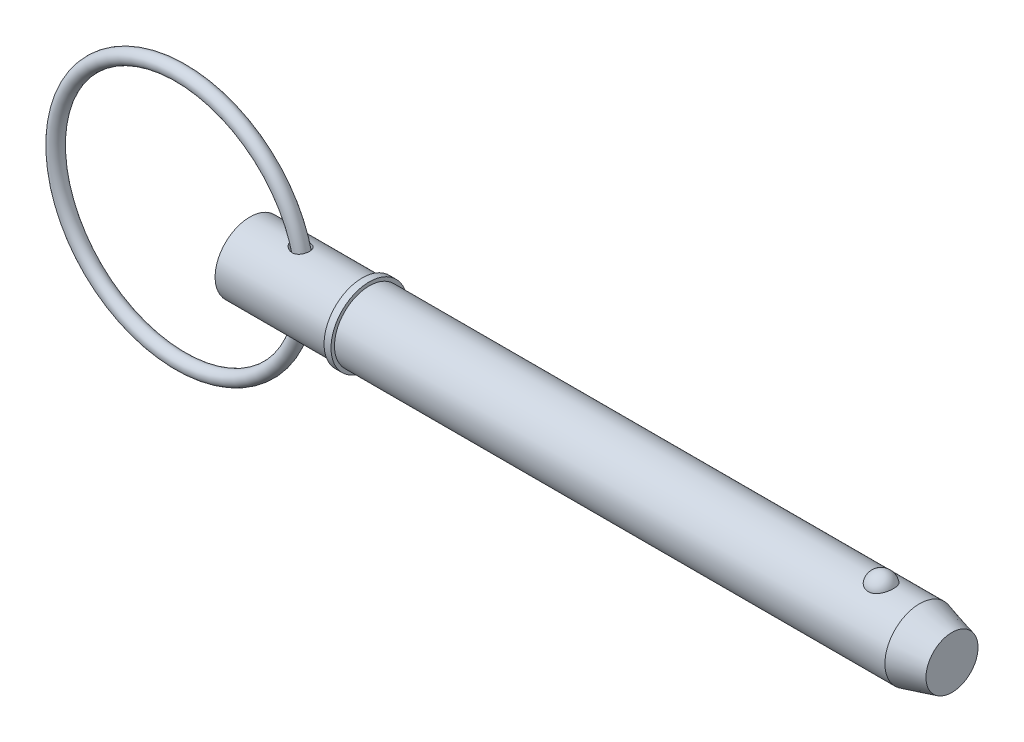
ISO-10303-21;
HEADER;
FILE_DESCRIPTION(('STEP AP214'),'2;1');
FILE_NAME('part.step','',(''),(''),'','','');
FILE_SCHEMA(('AUTOMOTIVE_DESIGN { 1 0 10303 214 1 1 1 1 }'));
ENDSEC;
DATA;
#1=APPLICATION_CONTEXT('core data for automotive mechanical design processes');
#2=APPLICATION_PROTOCOL_DEFINITION('international standard','automotive_design',2000,#1);
#3=PRODUCT_CONTEXT('',#1,'mechanical');
#4=PRODUCT('Part','Part','',(#3));
#5=PRODUCT_RELATED_PRODUCT_CATEGORY('part','',(#4));
#6=PRODUCT_DEFINITION_FORMATION('','',#4);
#7=PRODUCT_DEFINITION_CONTEXT('part definition',#1,'design');
#8=PRODUCT_DEFINITION('design','',#6,#7);
#9=PRODUCT_DEFINITION_SHAPE('','',#8);
#10=(LENGTH_UNIT() NAMED_UNIT(*) SI_UNIT(.MILLI.,.METRE.));
#11=(NAMED_UNIT(*) PLANE_ANGLE_UNIT() SI_UNIT($,.RADIAN.));
#12=(NAMED_UNIT(*) SI_UNIT($,.STERADIAN.) SOLID_ANGLE_UNIT());
#13=UNCERTAINTY_MEASURE_WITH_UNIT(LENGTH_MEASURE(1.E-05),#10,'distance_accuracy_value','');
#14=(GEOMETRIC_REPRESENTATION_CONTEXT(3) GLOBAL_UNCERTAINTY_ASSIGNED_CONTEXT((#13)) GLOBAL_UNIT_ASSIGNED_CONTEXT((#10,
#11,#12)) REPRESENTATION_CONTEXT('',''));
#15=CARTESIAN_POINT('',(0.,0.,0.));
#16=DIRECTION('',(0.,0.,1.));
#17=DIRECTION('',(1.,0.,0.));
#18=AXIS2_PLACEMENT_3D('',#15,#16,#17);
#19=CARTESIAN_POINT('',(-15.855506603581,0.,0.));
#20=DIRECTION('',(0.,0.,1.));
#21=DIRECTION('',(1.,0.,0.));
#22=AXIS2_PLACEMENT_3D('',#19,#20,#21);
#23=TOROIDAL_SURFACE('',#22,28.575,1.588);
#24=CARTESIAN_POINT('',(14.307493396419,0.,0.));
#25=VERTEX_POINT('',#24);
#26=VERTEX_LOOP('',#25);
#27=FACE_BOUND('',#26,.T.);
#28=ADVANCED_FACE('P0_F12',(#27),#23,.T.);
#29=CLOSED_SHELL('',(#28));
#30=MANIFOLD_SOLID_BREP('P0_B1',#29);
#31=CARTESIAN_POINT('',(0.,0.,0.));
#32=DIRECTION('',(1.,0.,0.));
#33=DIRECTION('',(0.,0.,-1.));
#34=AXIS2_PLACEMENT_3D('',#31,#32,#33);
#35=CYLINDRICAL_SURFACE('',#34,7.94);
#36=CARTESIAN_POINT('',(9.9064878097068,7.86092706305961,-1.11777712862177));
#37=CARTESIAN_POINT('',(9.98046148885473,7.84701054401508,-1.21564239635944));
#38=CARTESIAN_POINT('',(10.0632949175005,7.83217804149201,-1.30680329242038));
#39=CARTESIAN_POINT('',(10.243327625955,7.80247884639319,-1.47382688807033));
#40=CARTESIAN_POINT('',(10.3405572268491,7.78761214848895,-1.54965647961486));
#41=CARTESIAN_POINT('',(10.5460150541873,7.75960959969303,-1.6842723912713));
#42=CARTESIAN_POINT('',(10.654212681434,7.74646915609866,-1.74310445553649));
#43=CARTESIAN_POINT('',(10.8789333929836,7.72340979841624,-1.84259563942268));
#44=CARTESIAN_POINT('',(10.9954527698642,7.71348946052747,-1.88326279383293));
#45=CARTESIAN_POINT('',(11.2371543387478,7.69793327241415,-1.94589519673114));
#46=CARTESIAN_POINT('',(11.3624861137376,7.69242163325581,-1.96732022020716));
#47=CARTESIAN_POINT('',(11.6151110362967,7.68708151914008,-1.98809161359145));
#48=CARTESIAN_POINT('',(11.7424035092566,7.68725113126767,-1.98744541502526));
#49=CARTESIAN_POINT('',(11.9871377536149,7.69329740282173,-1.96389977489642));
#50=CARTESIAN_POINT('',(12.1047148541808,7.69883374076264,-1.94232728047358));
#51=CARTESIAN_POINT('',(12.3339179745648,7.7145667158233,-1.87886184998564));
#52=CARTESIAN_POINT('',(12.445546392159,7.72476145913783,-1.83697717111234));
#53=CARTESIAN_POINT('',(12.6521036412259,7.7477815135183,-1.73721211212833));
#54=CARTESIAN_POINT('',(12.7476463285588,7.76039274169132,-1.68054854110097));
#55=CARTESIAN_POINT('',(12.9274536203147,7.7871582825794,-1.55179691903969));
#56=CARTESIAN_POINT('',(13.0117191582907,7.8013124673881,-1.47971014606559));
#57=CARTESIAN_POINT('',(13.16544092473,7.82932755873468,-1.32341211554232));
#58=CARTESIAN_POINT('',(13.2351086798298,7.84318958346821,-1.23940873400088));
#59=CARTESIAN_POINT('',(13.3595610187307,7.86933512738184,-1.06080152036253));
#60=CARTESIAN_POINT('',(13.4143450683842,7.88161858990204,-0.966197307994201));
#61=CARTESIAN_POINT('',(13.5082288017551,7.90340571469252,-0.767990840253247));
#62=CARTESIAN_POINT('',(13.5471601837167,7.91287927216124,-0.664305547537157));
#63=CARTESIAN_POINT('',(13.6076213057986,7.92785679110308,-0.451705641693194));
#64=CARTESIAN_POINT('',(13.6291504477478,7.93336061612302,-0.342790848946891));
#65=CARTESIAN_POINT('',(13.6544025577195,7.93983472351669,-0.12204266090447));
#66=CARTESIAN_POINT('',(13.6580055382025,7.94077445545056,-0.0101946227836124));
#67=CARTESIAN_POINT('',(13.6469977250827,7.93793630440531,0.212542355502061));
#68=CARTESIAN_POINT('',(13.6323866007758,7.93415833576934,0.323431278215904));
#69=CARTESIAN_POINT('',(13.5852649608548,7.92228583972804,0.541194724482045));
#70=CARTESIAN_POINT('',(13.5527398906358,7.91418780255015,0.648065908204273));
#71=CARTESIAN_POINT('',(13.4705326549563,7.8945509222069,0.854658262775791));
#72=CARTESIAN_POINT('',(13.4208502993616,7.88301204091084,0.954379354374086));
#73=CARTESIAN_POINT('',(13.3056021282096,7.85778224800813,1.14366619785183));
#74=CARTESIAN_POINT('',(13.2400609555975,7.8440946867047,1.23324739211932));
#75=CARTESIAN_POINT('',(13.0946981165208,7.8160855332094,1.39984119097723));
#76=CARTESIAN_POINT('',(13.0148777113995,7.80176399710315,1.47685490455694));
#77=CARTESIAN_POINT('',(12.8438529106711,7.774237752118,1.61548556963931));
#78=CARTESIAN_POINT('',(12.7527554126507,7.76102428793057,1.67723263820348));
#79=CARTESIAN_POINT('',(12.5611987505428,7.73705789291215,1.78453696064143));
#80=CARTESIAN_POINT('',(12.4607407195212,7.72630466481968,1.83009617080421));
#81=CARTESIAN_POINT('',(12.2541997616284,7.70849465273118,1.90371822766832));
#82=CARTESIAN_POINT('',(12.1481665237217,7.7014098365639,1.93191408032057));
#83=CARTESIAN_POINT('',(11.9327851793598,7.69148605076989,1.97105353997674));
#84=CARTESIAN_POINT('',(11.8234367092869,7.68864754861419,1.98199524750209));
#85=CARTESIAN_POINT('',(11.6016024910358,7.68735890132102,1.98698770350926));
#86=CARTESIAN_POINT('',(11.4891069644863,7.68902083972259,1.98060702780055));
#87=CARTESIAN_POINT('',(11.2665484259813,7.6966276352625,1.95083303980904));
#88=CARTESIAN_POINT('',(11.1564861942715,7.70257384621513,1.92743434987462));
#89=CARTESIAN_POINT('',(10.9339966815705,7.71853798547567,1.86251478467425));
#90=CARTESIAN_POINT('',(10.8219140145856,7.72880438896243,1.81987394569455));
#91=CARTESIAN_POINT('',(10.6060441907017,7.75216432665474,1.7176403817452));
#92=CARTESIAN_POINT('',(10.5022611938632,7.76525926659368,1.65803922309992));
#93=CARTESIAN_POINT('',(10.3000447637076,7.79362794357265,1.51929354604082));
#94=CARTESIAN_POINT('',(10.2022480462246,7.80898310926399,1.43923272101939));
#95=CARTESIAN_POINT('',(10.0221668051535,7.83939672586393,1.26310118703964));
#96=CARTESIAN_POINT('',(9.93988168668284,7.85445518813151,1.16703109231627));
#97=CARTESIAN_POINT('',(9.79729823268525,7.88178950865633,0.964874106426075));
#98=CARTESIAN_POINT('',(9.73627994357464,7.89414970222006,0.859310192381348));
#99=CARTESIAN_POINT('',(9.63554001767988,7.91508909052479,0.638143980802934));
#100=CARTESIAN_POINT('',(9.59578986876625,7.92367334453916,0.522555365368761));
#101=CARTESIAN_POINT('',(9.54388714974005,7.93499161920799,0.300466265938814));
#102=CARTESIAN_POINT('',(9.52888458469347,7.93832727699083,0.194660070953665));
#103=CARTESIAN_POINT('',(9.51823078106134,7.94068976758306,-0.0179747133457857));
#104=CARTESIAN_POINT('',(9.52257317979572,7.93971801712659,-0.12480295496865));
#105=CARTESIAN_POINT('',(9.54911264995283,7.93386114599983,-0.326814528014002));
#106=CARTESIAN_POINT('',(9.56976509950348,7.92931471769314,-0.422217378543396));
#107=CARTESIAN_POINT('',(9.62591284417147,7.91721462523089,-0.608271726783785));
#108=CARTESIAN_POINT('',(9.66139801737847,7.90966301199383,-0.698926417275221));
#109=CARTESIAN_POINT('',(9.7317197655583,7.89515389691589,-0.844763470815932));
#110=CARTESIAN_POINT('',(9.76292633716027,7.88881879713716,-0.901801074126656));
#111=CARTESIAN_POINT('',(9.83075962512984,7.87538342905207,-1.01244242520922));
#112=CARTESIAN_POINT('',(9.86738597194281,7.86828321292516,-1.06604640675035));
#113=CARTESIAN_POINT('',(9.9064878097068,7.86092706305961,-1.11777712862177));
#114=B_SPLINE_CURVE_WITH_KNOTS('',3,(#36,#37,#38,#39,#40,#41,#42,#43,#44,#45,#46,#47,#48,#49,
#50,#51,#52,#53,#54,#55,#56,#57,#58,#59,#60,#61,#62,#63,#64,#65,#66,#67,#68,#69,#70,#71,#72,#73,
#74,#75,#76,#77,#78,#79,#80,#81,#82,#83,#84,#85,#86,#87,#88,#89,#90,#91,#92,#93,#94,#95,#96,#97,
#98,#99,#100,#101,#102,#103,#104,#105,#106,#107,#108,#109,#110,#111,#112,#113),.UNSPECIFIED.,
.T.,.F.,(4,2,2,2,2,2,2,2,2,2,2,2,2,2,2,2,2,2,2,2,2,2,2,2,2,2,2,2,2,2,2,2,2,2,2,2,2,2,4),(0.,
0.370138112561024,0.741067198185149,1.11098852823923,1.48074607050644,1.86058657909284,
2.24029919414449,2.59740885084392,2.95437345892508,3.2881332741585,3.6218654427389,
3.95036374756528,4.27887384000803,4.61078596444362,4.94270949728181,5.27685177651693,
5.61100012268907,5.94542035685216,6.27984429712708,6.61375187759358,6.94762997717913,
7.27855592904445,7.60944187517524,7.93776058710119,8.26611544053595,8.60272268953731,
8.93943635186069,9.29895306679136,9.65864886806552,10.0387340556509,10.4188046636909,
10.7843533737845,11.1494107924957,11.4683925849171,11.7872694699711,12.0791172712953,
12.3707662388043,12.5664313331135,12.7620830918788),.UNSPECIFIED.);
#115=CARTESIAN_POINT('',(9.9064878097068,7.86092706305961,-1.11777712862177));
#116=VERTEX_POINT('',#115);
#117=EDGE_CURVE('P1_E42',#116,#116,#114,.T.);
#118=ORIENTED_EDGE('',*,*,#117,.T.);
#119=EDGE_LOOP('',(#118));
#120=FACE_BOUND('',#119,.T.);
#121=CARTESIAN_POINT('',(0.,0.,0.));
#122=DIRECTION('',(1.,0.,0.));
#123=DIRECTION('',(0.,0.,-1.));
#124=AXIS2_PLACEMENT_3D('',#121,#122,#123);
#125=CIRCLE('',#124,7.94);
#126=CARTESIAN_POINT('',(0.,0.,-7.94));
#127=VERTEX_POINT('',#126);
#128=EDGE_CURVE('P1_E9',#127,#127,#125,.T.);
#129=ORIENTED_EDGE('',*,*,#128,.T.);
#130=EDGE_LOOP('',(#129));
#131=FACE_BOUND('',#130,.T.);
#132=CARTESIAN_POINT('',(25.722,0.,0.));
#133=DIRECTION('',(1.,0.,0.));
#134=DIRECTION('',(0.,0.,-1.));
#135=AXIS2_PLACEMENT_3D('',#132,#133,#134);
#136=CIRCLE('',#135,7.94);
#137=CARTESIAN_POINT('',(25.722,0.,-7.94));
#138=VERTEX_POINT('',#137);
#139=EDGE_CURVE('P1_E25',#138,#138,#136,.T.);
#140=ORIENTED_EDGE('',*,*,#139,.F.);
#141=EDGE_LOOP('',(#140));
#142=FACE_BOUND('',#141,.T.);
#143=CARTESIAN_POINT('',(9.9064878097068,-7.86092706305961,-1.11777712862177));
#144=CARTESIAN_POINT('',(9.84378768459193,-7.87272256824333,-1.03482250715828));
#145=CARTESIAN_POINT('',(9.7874122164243,-7.88386682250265,-0.947002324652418));
#146=CARTESIAN_POINT('',(9.68947008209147,-7.90377389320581,-0.763202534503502));
#147=CARTESIAN_POINT('',(9.64789384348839,-7.91253824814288,-0.667228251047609));
#148=CARTESIAN_POINT('',(9.58141396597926,-7.92676779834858,-0.468898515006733));
#149=CARTESIAN_POINT('',(9.55658638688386,-7.93221793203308,-0.366516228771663));
#150=CARTESIAN_POINT('',(9.525398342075,-7.9390896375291,-0.158837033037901));
#151=CARTESIAN_POINT('',(9.51903196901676,-7.94051249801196,-0.0535410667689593));
#152=CARTESIAN_POINT('',(9.5249639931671,-7.93919670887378,0.149856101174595));
#153=CARTESIAN_POINT('',(9.53611757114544,-7.9367132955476,0.247994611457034));
#154=CARTESIAN_POINT('',(9.57435037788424,-7.92833496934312,0.440949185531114));
#155=CARTESIAN_POINT('',(9.60143086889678,-7.92243978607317,0.535764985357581));
#156=CARTESIAN_POINT('',(9.67027872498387,-7.90782830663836,0.720026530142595));
#157=CARTESIAN_POINT('',(9.71210005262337,-7.89910165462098,0.809451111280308));
#158=CARTESIAN_POINT('',(9.80864905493,-7.87966534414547,0.980775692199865));
#159=CARTESIAN_POINT('',(9.86338092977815,-7.86895504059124,1.06267323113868));
#160=CARTESIAN_POINT('',(9.99009906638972,-7.84531573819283,1.22559225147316));
#161=CARTESIAN_POINT('',(10.0632770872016,-7.8322718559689,1.30566871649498));
#162=CARTESIAN_POINT('',(10.2208237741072,-7.80611237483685,1.45392159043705));
#163=CARTESIAN_POINT('',(10.3051986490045,-7.79299674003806,1.52209134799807));
#164=CARTESIAN_POINT('',(10.4935539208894,-7.76638841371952,1.65280871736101));
#165=CARTESIAN_POINT('',(10.5986730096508,-7.75303312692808,1.71374951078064));
#166=CARTESIAN_POINT('',(10.8175805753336,-7.72920597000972,1.81820073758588));
#167=CARTESIAN_POINT('',(10.9313721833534,-7.71873514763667,1.86170483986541));
#168=CARTESIAN_POINT('',(11.1696833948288,-7.70161777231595,1.93133079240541));
#169=CARTESIAN_POINT('',(11.2944525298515,-7.69514907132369,1.95665138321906));
#170=CARTESIAN_POINT('',(11.5466607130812,-7.6877908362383,1.98537345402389));
#171=CARTESIAN_POINT('',(11.6740986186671,-7.68689896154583,1.98878412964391));
#172=CARTESIAN_POINT('',(11.9206005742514,-7.690938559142,1.97309854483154));
#173=CARTESIAN_POINT('',(12.0397453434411,-7.69555832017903,1.95520713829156));
#174=CARTESIAN_POINT('',(12.2727177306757,-7.70968728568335,1.89872693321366));
#175=CARTESIAN_POINT('',(12.3865475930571,-7.71919440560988,1.86014695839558));
#176=CARTESIAN_POINT('',(12.5975118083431,-7.74115679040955,1.76641559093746));
#177=CARTESIAN_POINT('',(12.6952552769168,-7.75336701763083,1.71257254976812));
#178=CARTESIAN_POINT('',(12.8798510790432,-7.77962828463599,1.58901145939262));
#179=CARTESIAN_POINT('',(12.9667044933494,-7.79367914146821,1.51929498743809));
#180=CARTESIAN_POINT('',(13.1254818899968,-7.82172079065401,1.36751778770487));
#181=CARTESIAN_POINT('',(13.1976693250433,-7.83570718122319,1.28573131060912));
#182=CARTESIAN_POINT('',(13.3274495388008,-7.86236718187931,1.11111271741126));
#183=CARTESIAN_POINT('',(13.3850418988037,-7.87504075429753,1.01828028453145));
#184=CARTESIAN_POINT('',(13.4847470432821,-7.89782512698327,0.823214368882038));
#185=CARTESIAN_POINT('',(13.5267056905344,-7.90791011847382,0.720899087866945));
#186=CARTESIAN_POINT('',(13.5933891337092,-7.92427335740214,0.510509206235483));
#187=CARTESIAN_POINT('',(13.6181132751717,-7.9305514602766,0.402434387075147));
#188=CARTESIAN_POINT('',(13.6498843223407,-7.93866355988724,0.182728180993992));
#189=CARTESIAN_POINT('',(13.6567982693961,-7.94046412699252,0.07107630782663));
#190=CARTESIAN_POINT('',(13.6524060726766,-7.93933046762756,-0.151845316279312));
#191=CARTESIAN_POINT('',(13.6410996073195,-7.93639615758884,-0.26311506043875));
#192=CARTESIAN_POINT('',(13.6005023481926,-7.92610202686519,-0.482238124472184));
#193=CARTESIAN_POINT('',(13.571192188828,-7.91873744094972,-0.590087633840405));
#194=CARTESIAN_POINT('',(13.495246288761,-7.90037565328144,-0.799178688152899));
#195=CARTESIAN_POINT('',(13.4486102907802,-7.88937839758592,-0.900420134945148));
#196=CARTESIAN_POINT('',(13.3391817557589,-7.86497175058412,-1.09328280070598));
#197=CARTESIAN_POINT('',(13.2764083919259,-7.85156522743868,-1.18491525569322));
#198=CARTESIAN_POINT('',(13.1362355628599,-7.8238261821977,-1.35604994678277));
#199=CARTESIAN_POINT('',(13.0588372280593,-7.80949373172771,-1.43555311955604));
#200=CARTESIAN_POINT('',(12.8921392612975,-7.78164292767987,-1.57955181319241));
#201=CARTESIAN_POINT('',(12.8029410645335,-7.76811892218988,-1.64416363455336));
#202=CARTESIAN_POINT('',(12.6146622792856,-7.74328422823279,-1.75742016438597));
#203=CARTESIAN_POINT('',(12.5155829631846,-7.73197325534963,-1.80606692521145));
#204=CARTESIAN_POINT('',(12.31135301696,-7.71289290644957,-1.88588502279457));
#205=CARTESIAN_POINT('',(12.2062651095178,-7.70509254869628,-1.91720981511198));
#206=CARTESIAN_POINT('',(11.9922253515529,-7.69365188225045,-1.96261878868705));
#207=CARTESIAN_POINT('',(11.8832731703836,-7.69001193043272,-1.97670149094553));
#208=CARTESIAN_POINT('',(11.662174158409,-7.6871142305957,-1.98794112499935));
#209=CARTESIAN_POINT('',(11.5500082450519,-7.6879499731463,-1.98473694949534));
#210=CARTESIAN_POINT('',(11.3276038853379,-7.69396349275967,-1.96129119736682));
#211=CARTESIAN_POINT('',(11.2173659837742,-7.6991424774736,-1.94104488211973));
#212=CARTESIAN_POINT('',(10.9943151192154,-7.71363470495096,-1.8826578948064));
#213=CARTESIAN_POINT('',(10.8818004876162,-7.72319478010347,-1.8434396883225));
#214=CARTESIAN_POINT('',(10.6644693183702,-7.74534199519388,-1.74804607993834));
#215=CARTESIAN_POINT('',(10.5596578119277,-7.75793109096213,-1.69185971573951));
#216=CARTESIAN_POINT('',(10.3538333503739,-7.78563853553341,-1.5595801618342));
#217=CARTESIAN_POINT('',(10.2535123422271,-7.80086820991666,-1.48242881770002));
#218=CARTESIAN_POINT('',(10.0678634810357,-7.83136022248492,-1.31182139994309));
#219=CARTESIAN_POINT('',(9.98252491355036,-7.84662252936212,-1.21837707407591));
#220=CARTESIAN_POINT('',(9.9064878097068,-7.86092706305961,-1.11777712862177));
#221=B_SPLINE_CURVE_WITH_KNOTS('',3,(#143,#144,#145,#146,#147,#148,#149,#150,#151,#152,#153,
#154,#155,#156,#157,#158,#159,#160,#161,#162,#163,#164,#165,#166,#167,#168,#169,#170,#171,#172,
#173,#174,#175,#176,#177,#178,#179,#180,#181,#182,#183,#184,#185,#186,#187,#188,#189,#190,#191,
#192,#193,#194,#195,#196,#197,#198,#199,#200,#201,#202,#203,#204,#205,#206,#207,#208,#209,#210,
#211,#212,#213,#214,#215,#216,#217,#218,#219,#220),.UNSPECIFIED.,.T.,.F.,(4,2,2,2,2,2,2,2,2,2,2,
2,2,2,2,2,2,2,2,2,2,2,2,2,2,2,2,2,2,2,2,2,2,2,2,2,2,2,4),(0.,0.313593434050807,
0.626983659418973,0.941787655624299,1.25649090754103,1.55146990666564,1.84647228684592,
2.14256601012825,2.4387561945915,2.76521830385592,3.09186220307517,3.45696288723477,
3.82219601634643,4.20267276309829,4.58298981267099,4.94277962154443,5.30241610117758,
5.63754619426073,5.97264300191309,6.301049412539,6.62946524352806,6.96103833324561,
7.29262401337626,7.62667800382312,7.96073789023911,8.29515773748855,8.6295825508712,
8.96361184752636,9.29761533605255,9.62891449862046,9.96017105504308,10.288443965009,
10.616745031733,10.951930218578,11.2872086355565,11.6442788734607,12.0015802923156,
12.3821516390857,12.762449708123),.UNSPECIFIED.);
#222=CARTESIAN_POINT('',(9.9064878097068,-7.86092706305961,-1.11777712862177));
#223=VERTEX_POINT('',#222);
#224=EDGE_CURVE('P1_E17',#223,#223,#221,.T.);
#225=ORIENTED_EDGE('',*,*,#224,.T.);
#226=EDGE_LOOP('',(#225));
#227=FACE_BOUND('',#226,.T.);
#228=ADVANCED_FACE('P1_F13',(#120,#131,#142,#227),#35,.T.);
#229=CARTESIAN_POINT('',(0.,0.,0.));
#230=DIRECTION('',(1.,0.,0.));
#231=DIRECTION('',(0.,0.,-1.));
#232=AXIS2_PLACEMENT_3D('',#229,#230,#231);
#233=CYLINDRICAL_SURFACE('',#232,7.94);
#234=CARTESIAN_POINT('',(153.251879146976,0.,0.));
#235=DIRECTION('',(1.,0.,0.));
#236=DIRECTION('',(0.,0.,-1.));
#237=AXIS2_PLACEMENT_3D('',#234,#235,#236);
#238=CIRCLE('',#237,7.94);
#239=CARTESIAN_POINT('',(153.251879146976,0.,-7.94));
#240=VERTEX_POINT('',#239);
#241=EDGE_CURVE('P1_E99',#240,#240,#238,.T.);
#242=ORIENTED_EDGE('',*,*,#241,.F.);
#243=EDGE_LOOP('',(#242));
#244=FACE_BOUND('',#243,.T.);
#245=CARTESIAN_POINT('',(27.31,0.,0.));
#246=DIRECTION('',(1.,0.,0.));
#247=DIRECTION('',(0.,0.,-1.));
#248=AXIS2_PLACEMENT_3D('',#245,#246,#247);
#249=CIRCLE('',#248,7.94);
#250=CARTESIAN_POINT('',(27.31,0.,-7.94));
#251=VERTEX_POINT('',#250);
#252=EDGE_CURVE('P1_E96',#251,#251,#249,.T.);
#253=ORIENTED_EDGE('',*,*,#252,.T.);
#254=EDGE_LOOP('',(#253));
#255=FACE_BOUND('',#254,.T.);
#256=CARTESIAN_POINT('',(144.444907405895,7.37767842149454,2.93486986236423));
#257=CARTESIAN_POINT('',(144.292749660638,7.3776732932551,2.93487505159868));
#258=CARTESIAN_POINT('',(144.140632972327,7.38258419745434,2.92262454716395));
#259=CARTESIAN_POINT('',(143.840928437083,7.40163229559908,2.87404196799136));
#260=CARTESIAN_POINT('',(143.693339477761,7.41576720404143,2.83771585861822));
#261=CARTESIAN_POINT('',(143.407018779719,7.45161576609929,2.74218769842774));
#262=CARTESIAN_POINT('',(143.268274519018,7.47331841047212,2.68301886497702));
#263=CARTESIAN_POINT('',(143.002882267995,7.52194082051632,2.54350967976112));
#264=CARTESIAN_POINT('',(142.876236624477,7.54886159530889,2.46316523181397));
#265=CARTESIAN_POINT('',(142.634534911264,7.60594671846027,2.28090375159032));
#266=CARTESIAN_POINT('',(142.519906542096,7.63618114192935,2.1784421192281));
#267=CARTESIAN_POINT('',(142.308878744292,7.69614046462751,1.95608495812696));
#268=CARTESIAN_POINT('',(142.212482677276,7.72586526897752,1.83618622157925));
#269=CARTESIAN_POINT('',(142.035938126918,7.78314821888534,1.57628086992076));
#270=CARTESIAN_POINT('',(141.956707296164,7.81055035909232,1.43561546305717));
#271=CARTESIAN_POINT('',(141.821797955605,7.85879631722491,1.14236334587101));
#272=CARTESIAN_POINT('',(141.766121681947,7.87963951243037,0.989775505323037));
#273=CARTESIAN_POINT('',(141.67881215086,7.91289645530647,0.674619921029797));
#274=CARTESIAN_POINT('',(141.64753090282,7.92518652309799,0.511941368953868));
#275=CARTESIAN_POINT('',(141.610975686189,7.93958930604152,0.183247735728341));
#276=CARTESIAN_POINT('',(141.605701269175,7.94170219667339,0.0172327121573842));
#277=CARTESIAN_POINT('',(141.621231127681,7.93554931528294,-0.312672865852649));
#278=CARTESIAN_POINT('',(141.641925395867,7.92732732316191,-0.476569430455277));
#279=CARTESIAN_POINT('',(141.70878655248,7.90141534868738,-0.79830524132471));
#280=CARTESIAN_POINT('',(141.754953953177,7.88372517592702,-0.956144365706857));
#281=CARTESIAN_POINT('',(141.871898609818,7.84066230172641,-1.26152073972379));
#282=CARTESIAN_POINT('',(141.942704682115,7.81528060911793,-1.40904568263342));
#283=CARTESIAN_POINT('',(142.107478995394,7.75948672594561,-1.68950598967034));
#284=CARTESIAN_POINT('',(142.201448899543,7.72907417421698,-1.82244030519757));
#285=CARTESIAN_POINT('',(142.410839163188,7.66640424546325,-2.07032792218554));
#286=CARTESIAN_POINT('',(142.526315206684,7.63414223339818,-2.18523308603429));
#287=CARTESIAN_POINT('',(142.7759006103,7.57149681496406,-2.39329737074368));
#288=CARTESIAN_POINT('',(142.910008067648,7.54111321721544,-2.48645870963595));
#289=CARTESIAN_POINT('',(143.190111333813,7.48650742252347,-2.64628132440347));
#290=CARTESIAN_POINT('',(143.335760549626,7.46215900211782,-2.71350554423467));
#291=CARTESIAN_POINT('',(143.637425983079,7.42171253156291,-2.82226614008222));
#292=CARTESIAN_POINT('',(143.793438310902,7.40561140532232,-2.86381209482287));
#293=CARTESIAN_POINT('',(144.102970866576,7.3842679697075,-2.9183907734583));
#294=CARTESIAN_POINT('',(144.256222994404,7.37852109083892,-2.93275024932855));
#295=CARTESIAN_POINT('',(144.563070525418,7.37700973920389,-2.93655208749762));
#296=CARTESIAN_POINT('',(144.716665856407,7.38124333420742,-2.92599927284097));
#297=CARTESIAN_POINT('',(145.014990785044,7.39890635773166,-2.88102897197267));
#298=CARTESIAN_POINT('',(145.159848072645,7.41205491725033,-2.84733999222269));
#299=CARTESIAN_POINT('',(145.44164329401,7.445801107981,-2.75788206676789));
#300=CARTESIAN_POINT('',(145.578580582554,7.46639934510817,-2.70211132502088));
#301=CARTESIAN_POINT('',(145.844061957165,7.51339098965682,-2.56858908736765));
#302=CARTESIAN_POINT('',(145.972354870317,7.53990200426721,-2.4903806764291));
#303=CARTESIAN_POINT('',(146.214244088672,7.59569503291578,-2.31462737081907));
#304=CARTESIAN_POINT('',(146.327837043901,7.6249776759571,-2.21707808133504));
#305=CARTESIAN_POINT('',(146.54322156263,7.68489473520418,-1.99982049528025));
#306=CARTESIAN_POINT('',(146.644148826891,7.71552419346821,-1.87925337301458));
#307=CARTESIAN_POINT('',(146.825186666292,7.77353016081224,-1.6226882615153));
#308=CARTESIAN_POINT('',(146.905293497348,7.80090608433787,-1.48668750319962));
#309=CARTESIAN_POINT('',(147.045361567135,7.85047992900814,-1.1981841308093));
#310=CARTESIAN_POINT('',(147.104587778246,7.87248183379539,-1.04529016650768));
#311=CARTESIAN_POINT('',(147.197982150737,7.90785114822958,-0.731080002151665));
#312=CARTESIAN_POINT('',(147.232149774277,7.92121837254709,-0.569763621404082));
#313=CARTESIAN_POINT('',(147.274795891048,7.93797834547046,-0.242812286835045));
#314=CARTESIAN_POINT('',(147.283204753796,7.94134405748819,-0.0771668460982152));
#315=CARTESIAN_POINT('',(147.273962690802,7.93767937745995,0.253276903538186));
#316=CARTESIAN_POINT('',(147.256312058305,7.93064910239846,0.418075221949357));
#317=CARTESIAN_POINT('',(147.195424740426,7.90695571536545,0.741525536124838));
#318=CARTESIAN_POINT('',(147.152281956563,7.8903279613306,0.900197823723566));
#319=CARTESIAN_POINT('',(147.04135358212,7.84916386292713,1.20759654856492));
#320=CARTESIAN_POINT('',(146.97356656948,7.82462706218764,1.35632241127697));
#321=CARTESIAN_POINT('',(146.814371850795,7.77006699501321,1.64032869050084));
#322=CARTESIAN_POINT('',(146.722861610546,7.74002008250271,1.7755471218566));
#323=CARTESIAN_POINT('',(146.518296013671,7.67774175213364,2.0280064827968));
#324=CARTESIAN_POINT('',(146.405241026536,7.64551037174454,2.14524772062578));
#325=CARTESIAN_POINT('',(146.160831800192,7.58265895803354,2.35778002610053));
#326=CARTESIAN_POINT('',(146.029583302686,7.5520309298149,2.45319004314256));
#327=CARTESIAN_POINT('',(145.751601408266,7.49579792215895,2.61999897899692));
#328=CARTESIAN_POINT('',(145.604867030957,7.4701932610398,2.69139637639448));
#329=CARTESIAN_POINT('',(145.292947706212,7.42622216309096,2.8105324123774));
#330=CARTESIAN_POINT('',(145.127220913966,7.40825002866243,2.85700910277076));
#331=CARTESIAN_POINT('',(144.789279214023,7.38398348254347,2.9191685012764));
#332=CARTESIAN_POINT('',(144.61706702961,7.3776842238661,2.93486399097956));
#333=CARTESIAN_POINT('',(144.444907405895,7.37767842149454,2.93486986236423));
#334=B_SPLINE_CURVE_WITH_KNOTS('',3,(#256,#257,#258,#259,#260,#261,#262,#263,#264,#265,#266,
#267,#268,#269,#270,#271,#272,#273,#274,#275,#276,#277,#278,#279,#280,#281,#282,#283,#284,#285,
#286,#287,#288,#289,#290,#291,#292,#293,#294,#295,#296,#297,#298,#299,#300,#301,#302,#303,#304,
#305,#306,#307,#308,#309,#310,#311,#312,#313,#314,#315,#316,#317,#318,#319,#320,#321,#322,#323,
#324,#325,#326,#327,#328,#329,#330,#331,#332,#333),.UNSPECIFIED.,.T.,.F.,(4,2,2,2,2,2,2,2,2,2,2,
2,2,2,2,2,2,2,2,2,2,2,2,2,2,2,2,2,2,2,2,2,2,2,2,2,2,2,4),(0.,0.455841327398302,
0.911569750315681,1.36663794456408,1.82179423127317,2.2897898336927,2.75787163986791,
3.24685368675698,3.73588214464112,4.23184282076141,4.72779494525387,5.22165321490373,
5.71552141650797,6.20996917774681,6.7044524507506,7.20023431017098,7.69596557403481,
8.18023418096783,8.66432203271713,9.12410697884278,9.58380291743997,10.0296503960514,
10.4755341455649,10.9312349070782,11.3870393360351,11.8654416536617,12.3439299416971,
12.8378875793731,13.3318558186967,13.8271581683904,14.3224549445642,14.8159385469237,
15.3094506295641,15.8051323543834,16.3008055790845,16.7937101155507,17.2866458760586,
17.8026240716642,18.3183879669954),.UNSPECIFIED.);
#335=CARTESIAN_POINT('',(144.444907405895,7.37767842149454,2.93486986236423));
#336=VERTEX_POINT('',#335);
#337=EDGE_CURVE('P1_E34',#336,#336,#334,.T.);
#338=ORIENTED_EDGE('',*,*,#337,.T.);
#339=EDGE_LOOP('',(#338));
#340=FACE_BOUND('',#339,.T.);
#341=ADVANCED_FACE('P1_F46',(#244,#255,#340),#233,.T.);
#342=CARTESIAN_POINT('',(0.,0.,0.));
#343=DIRECTION('',(-1.,0.,0.));
#344=DIRECTION('',(0.,0.,1.));
#345=AXIS2_PLACEMENT_3D('',#342,#343,#344);
#346=PLANE('',#345);
#347=ORIENTED_EDGE('',*,*,#128,.F.);
#348=EDGE_LOOP('',(#347));
#349=FACE_BOUND('',#348,.T.);
#350=ADVANCED_FACE('P1_F15',(#349),#346,.T.);
#351=CARTESIAN_POINT('',(25.722,7.94,0.));
#352=DIRECTION('',(-1.,0.,0.));
#353=DIRECTION('',(0.,0.,1.));
#354=AXIS2_PLACEMENT_3D('',#351,#352,#353);
#355=PLANE('',#354);
#356=ORIENTED_EDGE('',*,*,#139,.T.);
#357=EDGE_LOOP('',(#356));
#358=FACE_BOUND('',#357,.T.);
#359=CARTESIAN_POINT('',(25.722,0.,0.));
#360=DIRECTION('',(1.,0.,0.));
#361=DIRECTION('',(0.,0.,-1.));
#362=AXIS2_PLACEMENT_3D('',#359,#360,#361);
#363=CIRCLE('',#362,8.734);
#364=CARTESIAN_POINT('',(25.722,0.,-8.734));
#365=VERTEX_POINT('',#364);
#366=EDGE_CURVE('P1_E30',#365,#365,#363,.T.);
#367=ORIENTED_EDGE('',*,*,#366,.F.);
#368=EDGE_LOOP('',(#367));
#369=FACE_BOUND('',#368,.T.);
#370=ADVANCED_FACE('P1_F81',(#358,#369),#355,.T.);
#371=CARTESIAN_POINT('',(0.,0.,0.));
#372=DIRECTION('',(1.,0.,0.));
#373=DIRECTION('',(0.,0.,-1.));
#374=AXIS2_PLACEMENT_3D('',#371,#372,#373);
#375=CYLINDRICAL_SURFACE('',#374,8.734);
#376=ORIENTED_EDGE('',*,*,#366,.T.);
#377=EDGE_LOOP('',(#376));
#378=FACE_BOUND('',#377,.T.);
#379=CARTESIAN_POINT('',(27.31,0.,0.));
#380=DIRECTION('',(1.,0.,0.));
#381=DIRECTION('',(0.,0.,-1.));
#382=AXIS2_PLACEMENT_3D('',#379,#380,#381);
#383=CIRCLE('',#382,8.734);
#384=CARTESIAN_POINT('',(27.31,0.,-8.734));
#385=VERTEX_POINT('',#384);
#386=EDGE_CURVE('P1_E95',#385,#385,#383,.T.);
#387=ORIENTED_EDGE('',*,*,#386,.F.);
#388=EDGE_LOOP('',(#387));
#389=FACE_BOUND('',#388,.T.);
#390=ADVANCED_FACE('P1_F68',(#378,#389),#375,.T.);
#391=CARTESIAN_POINT('',(27.31,8.734,0.));
#392=DIRECTION('',(1.,0.,0.));
#393=DIRECTION('',(0.,0.,-1.));
#394=AXIS2_PLACEMENT_3D('',#391,#392,#393);
#395=PLANE('',#394);
#396=ORIENTED_EDGE('',*,*,#386,.T.);
#397=EDGE_LOOP('',(#396));
#398=FACE_BOUND('',#397,.T.);
#399=ORIENTED_EDGE('',*,*,#252,.F.);
#400=EDGE_LOOP('',(#399));
#401=FACE_BOUND('',#400,.T.);
#402=ADVANCED_FACE('P1_F62',(#398,#401),#395,.T.);
#403=CARTESIAN_POINT('',(160.66,0.,0.));
#404=DIRECTION('',(-1.,0.,0.));
#405=DIRECTION('',(0.,0.,1.));
#406=AXIS2_PLACEMENT_3D('',#403,#404,#405);
#407=CONICAL_SURFACE('',#406,5.95500000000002,0.26179938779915);
#408=ORIENTED_EDGE('',*,*,#241,.T.);
#409=EDGE_LOOP('',(#408));
#410=FACE_BOUND('',#409,.T.);
#411=CARTESIAN_POINT('',(160.66,0.,0.));
#412=DIRECTION('',(1.,0.,0.));
#413=DIRECTION('',(0.,0.,-1.));
#414=AXIS2_PLACEMENT_3D('',#411,#412,#413);
#415=CIRCLE('',#414,5.95500000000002);
#416=CARTESIAN_POINT('',(160.66,0.,-5.95500000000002));
#417=VERTEX_POINT('',#416);
#418=EDGE_CURVE('P1_E41',#417,#417,#415,.T.);
#419=ORIENTED_EDGE('',*,*,#418,.F.);
#420=EDGE_LOOP('',(#419));
#421=FACE_BOUND('',#420,.T.);
#422=ADVANCED_FACE('P1_F59',(#410,#421),#407,.T.);
#423=CARTESIAN_POINT('',(160.66,5.95500000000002,0.));
#424=DIRECTION('',(1.,0.,0.));
#425=DIRECTION('',(0.,0.,-1.));
#426=AXIS2_PLACEMENT_3D('',#423,#424,#425);
#427=PLANE('',#426);
#428=ORIENTED_EDGE('',*,*,#418,.T.);
#429=EDGE_LOOP('',(#428));
#430=FACE_BOUND('',#429,.T.);
#431=ADVANCED_FACE('P1_F55',(#430),#427,.T.);
#432=CARTESIAN_POINT('',(144.444907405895,7.146,0.));
#433=DIRECTION('',(-1.,0.,0.));
#434=DIRECTION('',(0.,1.,0.));
#435=AXIS2_PLACEMENT_3D('',#432,#433,#434);
#436=SPHERICAL_SURFACE('',#435,2.944);
#437=ORIENTED_EDGE('',*,*,#337,.F.);
#438=EDGE_LOOP('',(#437));
#439=FACE_BOUND('',#438,.T.);
#440=ADVANCED_FACE('P1_F50',(#439),#436,.T.);
#441=CARTESIAN_POINT('',(-15.855506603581,0.,0.));
#442=DIRECTION('',(0.,0.,1.));
#443=DIRECTION('',(1.,0.,0.));
#444=AXIS2_PLACEMENT_3D('',#441,#442,#443);
#445=TOROIDAL_SURFACE('',#444,28.575,1.985);
#446=ORIENTED_EDGE('',*,*,#224,.F.);
#447=EDGE_LOOP('',(#446));
#448=FACE_BOUND('',#447,.T.);
#449=ORIENTED_EDGE('',*,*,#117,.F.);
#450=EDGE_LOOP('',(#449));
#451=FACE_BOUND('',#450,.T.);
#452=ADVANCED_FACE('P1_F54',(#448,#451),#445,.F.);
#453=CLOSED_SHELL('',(#228,#341,#350,#370,#390,#402,#422,#431,#440,#452));
#454=MANIFOLD_SOLID_BREP('P1_B1',#453);
#455=ADVANCED_BREP_SHAPE_REPRESENTATION('',(#18,#30,#454),#14);
#456=SHAPE_DEFINITION_REPRESENTATION(#9,#455);
ENDSEC;
END-ISO-10303-21;
